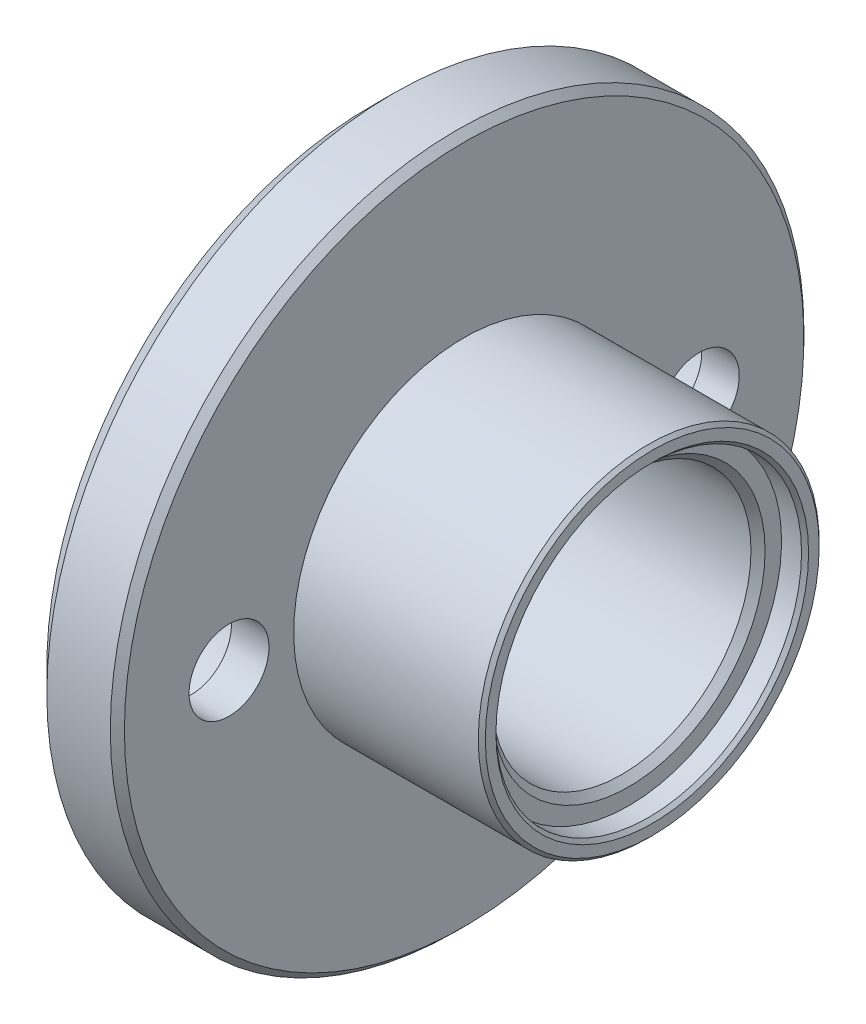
ISO-10303-21;
HEADER;
FILE_DESCRIPTION(('STEP AP214'),'2;1');
FILE_NAME('part.step','',(''),(''),'','','');
FILE_SCHEMA(('AUTOMOTIVE_DESIGN { 1 0 10303 214 1 1 1 1 }'));
ENDSEC;
DATA;
#1=APPLICATION_CONTEXT('core data for automotive mechanical design processes');
#2=APPLICATION_PROTOCOL_DEFINITION('international standard','automotive_design',2000,#1);
#3=PRODUCT_CONTEXT('',#1,'mechanical');
#4=PRODUCT('Part','Part','',(#3));
#5=PRODUCT_RELATED_PRODUCT_CATEGORY('part','',(#4));
#6=PRODUCT_DEFINITION_FORMATION('','',#4);
#7=PRODUCT_DEFINITION_CONTEXT('part definition',#1,'design');
#8=PRODUCT_DEFINITION('design','',#6,#7);
#9=PRODUCT_DEFINITION_SHAPE('','',#8);
#10=(LENGTH_UNIT() NAMED_UNIT(*) SI_UNIT(.MILLI.,.METRE.));
#11=(NAMED_UNIT(*) PLANE_ANGLE_UNIT() SI_UNIT($,.RADIAN.));
#12=(NAMED_UNIT(*) SI_UNIT($,.STERADIAN.) SOLID_ANGLE_UNIT());
#13=UNCERTAINTY_MEASURE_WITH_UNIT(LENGTH_MEASURE(1.E-05),#10,'distance_accuracy_value','');
#14=(GEOMETRIC_REPRESENTATION_CONTEXT(3) GLOBAL_UNCERTAINTY_ASSIGNED_CONTEXT((#13)) GLOBAL_UNIT_ASSIGNED_CONTEXT((#10,
#11,#12)) REPRESENTATION_CONTEXT('',''));
#15=CARTESIAN_POINT('',(0.,0.,0.));
#16=DIRECTION('',(0.,0.,1.));
#17=DIRECTION('',(1.,0.,0.));
#18=AXIS2_PLACEMENT_3D('',#15,#16,#17);
#19=CARTESIAN_POINT('',(12.6,0.,0.));
#20=DIRECTION('',(-1.,0.,0.));
#21=DIRECTION('',(0.,-1.,0.));
#22=AXIS2_PLACEMENT_3D('',#19,#20,#21);
#23=CYLINDRICAL_SURFACE('',#22,6.5);
#24=CARTESIAN_POINT('',(11.8499999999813,0.,0.));
#25=DIRECTION('',(1.,0.,0.));
#26=DIRECTION('',(0.,0.,-1.));
#27=AXIS2_PLACEMENT_3D('',#24,#25,#26);
#28=CIRCLE('',#27,6.50000000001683);
#29=CARTESIAN_POINT('',(11.8499999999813,0.,-6.50000000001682));
#30=VERTEX_POINT('',#29);
#31=EDGE_CURVE('E29',#30,#30,#28,.T.);
#32=ORIENTED_EDGE('',*,*,#31,.T.);
#33=EDGE_LOOP('',(#32));
#34=FACE_BOUND('',#33,.T.);
#35=CARTESIAN_POINT('',(11.,0.,0.));
#36=DIRECTION('',(-1.,0.,0.));
#37=DIRECTION('',(0.,-1.,0.));
#38=AXIS2_PLACEMENT_3D('',#35,#36,#37);
#39=CIRCLE('',#38,6.5);
#40=CARTESIAN_POINT('',(11.,-6.5,0.));
#41=VERTEX_POINT('',#40);
#42=EDGE_CURVE('E17',#41,#41,#39,.T.);
#43=ORIENTED_EDGE('',*,*,#42,.T.);
#44=EDGE_LOOP('',(#43));
#45=FACE_BOUND('',#44,.T.);
#46=ADVANCED_FACE('F14',(#34,#45),#23,.F.);
#47=CARTESIAN_POINT('',(11.9999999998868,0.,0.));
#48=DIRECTION('',(1.,0.,0.));
#49=DIRECTION('',(0.,0.,-1.));
#50=AXIS2_PLACEMENT_3D('',#47,#48,#49);
#51=CONICAL_SURFACE('',#50,6.64999999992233,0.785398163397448);
#52=ORIENTED_EDGE('',*,*,#31,.F.);
#53=EDGE_LOOP('',(#52));
#54=FACE_BOUND('',#53,.T.);
#55=CARTESIAN_POINT('',(12.0000000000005,0.,0.));
#56=DIRECTION('',(1.,0.,0.));
#57=DIRECTION('',(0.,0.,-1.));
#58=AXIS2_PLACEMENT_3D('',#55,#56,#57);
#59=CIRCLE('',#58,6.65000000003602);
#60=CARTESIAN_POINT('',(12.0000000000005,0.,-6.65000000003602));
#61=VERTEX_POINT('',#60);
#62=EDGE_CURVE('E77',#61,#61,#59,.T.);
#63=ORIENTED_EDGE('',*,*,#62,.T.);
#64=EDGE_LOOP('',(#63));
#65=FACE_BOUND('',#64,.T.);
#66=ADVANCED_FACE('F88',(#54,#65),#51,.F.);
#67=CARTESIAN_POINT('',(11.,0.,0.));
#68=DIRECTION('',(-1.,0.,0.));
#69=DIRECTION('',(0.,-1.,0.));
#70=AXIS2_PLACEMENT_3D('',#67,#68,#69);
#71=PLANE('',#70);
#72=ORIENTED_EDGE('',*,*,#42,.F.);
#73=EDGE_LOOP('',(#72));
#74=FACE_BOUND('',#73,.T.);
#75=CARTESIAN_POINT('',(11.0000000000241,0.,0.));
#76=DIRECTION('',(1.,0.,0.));
#77=DIRECTION('',(0.,0.,-1.));
#78=AXIS2_PLACEMENT_3D('',#75,#76,#77);
#79=CIRCLE('',#78,5.80000000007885);
#80=CARTESIAN_POINT('',(11.0000000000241,0.,-5.80000000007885));
#81=VERTEX_POINT('',#80);
#82=EDGE_CURVE('E75',#81,#81,#79,.F.);
#83=ORIENTED_EDGE('',*,*,#82,.T.);
#84=EDGE_LOOP('',(#83));
#85=FACE_BOUND('',#84,.T.);
#86=ADVANCED_FACE('F90',(#74,#85),#71,.F.);
#87=CARTESIAN_POINT('',(12.0000000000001,0.,0.));
#88=DIRECTION('',(-1.,0.,0.));
#89=DIRECTION('',(0.,-1.,0.));
#90=AXIS2_PLACEMENT_3D('',#87,#88,#89);
#91=PLANE('',#90);
#92=CARTESIAN_POINT('',(12.,0.,1.11022302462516E-13));
#93=DIRECTION('',(-1.,0.,0.));
#94=DIRECTION('',(0.,0.,1.));
#95=AXIS2_PLACEMENT_3D('',#92,#93,#94);
#96=CIRCLE('',#95,7.10000000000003);
#97=CARTESIAN_POINT('',(12.,0.,7.10000000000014));
#98=VERTEX_POINT('',#97);
#99=EDGE_CURVE('E71',#98,#98,#96,.T.);
#100=ORIENTED_EDGE('',*,*,#99,.F.);
#101=EDGE_LOOP('',(#100));
#102=FACE_BOUND('',#101,.T.);
#103=ORIENTED_EDGE('',*,*,#62,.F.);
#104=EDGE_LOOP('',(#103));
#105=FACE_BOUND('',#104,.T.);
#106=ADVANCED_FACE('F96',(#102,#105),#91,.F.);
#107=CARTESIAN_POINT('',(11.0000000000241,0.,0.));
#108=DIRECTION('',(1.,0.,0.));
#109=DIRECTION('',(0.,0.,-1.));
#110=AXIS2_PLACEMENT_3D('',#107,#108,#109);
#111=CONICAL_SURFACE('',#110,5.80000000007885,0.785398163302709);
#112=CARTESIAN_POINT('',(10.7,0.,0.));
#113=DIRECTION('',(-1.,0.,0.));
#114=DIRECTION('',(0.,-1.,0.));
#115=AXIS2_PLACEMENT_3D('',#112,#113,#114);
#116=CIRCLE('',#115,5.5);
#117=CARTESIAN_POINT('',(10.7,-5.5,0.));
#118=VERTEX_POINT('',#117);
#119=EDGE_CURVE('E74',#118,#118,#116,.T.);
#120=ORIENTED_EDGE('',*,*,#119,.T.);
#121=EDGE_LOOP('',(#120));
#122=FACE_BOUND('',#121,.T.);
#123=ORIENTED_EDGE('',*,*,#82,.F.);
#124=EDGE_LOOP('',(#123));
#125=FACE_BOUND('',#124,.T.);
#126=ADVANCED_FACE('F181',(#122,#125),#111,.F.);
#127=CARTESIAN_POINT('',(11.85,0.,1.11022302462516E-13));
#128=DIRECTION('',(-1.,0.,0.));
#129=DIRECTION('',(0.,0.,1.));
#130=AXIS2_PLACEMENT_3D('',#127,#128,#129);
#131=CONICAL_SURFACE('',#130,7.24999999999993,0.785398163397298);
#132=ORIENTED_EDGE('',*,*,#99,.T.);
#133=EDGE_LOOP('',(#132));
#134=FACE_BOUND('',#133,.T.);
#135=CARTESIAN_POINT('',(11.85,0.,0.));
#136=DIRECTION('',(-1.,0.,0.));
#137=DIRECTION('',(0.,-1.,0.));
#138=AXIS2_PLACEMENT_3D('',#135,#136,#137);
#139=CIRCLE('',#138,7.25);
#140=CARTESIAN_POINT('',(11.85,-7.25,0.));
#141=VERTEX_POINT('',#140);
#142=EDGE_CURVE('E70',#141,#141,#139,.T.);
#143=ORIENTED_EDGE('',*,*,#142,.F.);
#144=EDGE_LOOP('',(#143));
#145=FACE_BOUND('',#144,.T.);
#146=ADVANCED_FACE('F177',(#134,#145),#131,.T.);
#147=CARTESIAN_POINT('',(12.6,0.,0.));
#148=DIRECTION('',(-1.,0.,0.));
#149=DIRECTION('',(0.,-1.,0.));
#150=AXIS2_PLACEMENT_3D('',#147,#148,#149);
#151=CYLINDRICAL_SURFACE('',#150,5.5);
#152=ORIENTED_EDGE('',*,*,#119,.F.);
#153=EDGE_LOOP('',(#152));
#154=FACE_BOUND('',#153,.T.);
#155=CARTESIAN_POINT('',(2.,0.,0.));
#156=DIRECTION('',(-1.,0.,0.));
#157=DIRECTION('',(0.,-1.,0.));
#158=AXIS2_PLACEMENT_3D('',#155,#156,#157);
#159=CIRCLE('',#158,5.5);
#160=CARTESIAN_POINT('',(2.,-5.5,0.));
#161=VERTEX_POINT('',#160);
#162=EDGE_CURVE('E67',#161,#161,#159,.T.);
#163=ORIENTED_EDGE('',*,*,#162,.T.);
#164=EDGE_LOOP('',(#163));
#165=FACE_BOUND('',#164,.T.);
#166=ADVANCED_FACE('F173',(#154,#165),#151,.F.);
#167=CARTESIAN_POINT('',(12.6,0.,0.));
#168=DIRECTION('',(-1.,0.,0.));
#169=DIRECTION('',(0.,-1.,0.));
#170=AXIS2_PLACEMENT_3D('',#167,#168,#169);
#171=CYLINDRICAL_SURFACE('',#170,7.25);
#172=ORIENTED_EDGE('',*,*,#142,.T.);
#173=EDGE_LOOP('',(#172));
#174=FACE_BOUND('',#173,.T.);
#175=CARTESIAN_POINT('',(4.00000000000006,0.,0.));
#176=DIRECTION('',(-1.,0.,0.));
#177=DIRECTION('',(0.,-1.,0.));
#178=AXIS2_PLACEMENT_3D('',#175,#176,#177);
#179=CIRCLE('',#178,7.25);
#180=CARTESIAN_POINT('',(4.00000000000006,-7.25,0.));
#181=VERTEX_POINT('',#180);
#182=EDGE_CURVE('E61',#181,#181,#179,.F.);
#183=ORIENTED_EDGE('',*,*,#182,.T.);
#184=EDGE_LOOP('',(#183));
#185=FACE_BOUND('',#184,.T.);
#186=ADVANCED_FACE('F169',(#174,#185),#171,.T.);
#187=CARTESIAN_POINT('',(10.5,0.,10.));
#188=DIRECTION('',(-1.,0.,0.));
#189=DIRECTION('',(0.,-1.,0.));
#190=AXIS2_PLACEMENT_3D('',#187,#188,#189);
#191=CYLINDRICAL_SURFACE('',#190,1.7);
#192=CARTESIAN_POINT('',(4.00000000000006,0.,10.));
#193=DIRECTION('',(-1.,0.,0.));
#194=DIRECTION('',(0.,-1.,0.));
#195=AXIS2_PLACEMENT_3D('',#192,#193,#194);
#196=CIRCLE('',#195,1.7);
#197=CARTESIAN_POINT('',(4.00000000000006,-1.7,10.));
#198=VERTEX_POINT('',#197);
#199=EDGE_CURVE('E64',#198,#198,#196,.F.);
#200=ORIENTED_EDGE('',*,*,#199,.T.);
#201=EDGE_LOOP('',(#200));
#202=FACE_BOUND('',#201,.T.);
#203=CARTESIAN_POINT('',(2.40000000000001,0.,10.));
#204=DIRECTION('',(-1.,0.,0.));
#205=DIRECTION('',(0.,-1.,0.));
#206=AXIS2_PLACEMENT_3D('',#203,#204,#205);
#207=CIRCLE('',#206,1.7);
#208=CARTESIAN_POINT('',(2.40000000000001,-1.7,10.));
#209=VERTEX_POINT('',#208);
#210=EDGE_CURVE('E55',#209,#209,#207,.F.);
#211=ORIENTED_EDGE('',*,*,#210,.F.);
#212=EDGE_LOOP('',(#211));
#213=FACE_BOUND('',#212,.T.);
#214=ADVANCED_FACE('F165',(#202,#213),#191,.F.);
#215=CARTESIAN_POINT('',(2.,0.,0.));
#216=DIRECTION('',(-1.,0.,0.));
#217=DIRECTION('',(0.,-1.,0.));
#218=AXIS2_PLACEMENT_3D('',#215,#216,#217);
#219=PLANE('',#218);
#220=ORIENTED_EDGE('',*,*,#162,.F.);
#221=EDGE_LOOP('',(#220));
#222=FACE_BOUND('',#221,.T.);
#223=CARTESIAN_POINT('',(2.00000000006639,0.,0.));
#224=DIRECTION('',(1.,0.,0.));
#225=DIRECTION('',(0.,0.,-1.));
#226=AXIS2_PLACEMENT_3D('',#223,#224,#225);
#227=CIRCLE('',#226,2.64999999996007);
#228=CARTESIAN_POINT('',(2.00000000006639,0.,-2.64999999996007));
#229=VERTEX_POINT('',#228);
#230=EDGE_CURVE('E52',#229,#229,#227,.F.);
#231=ORIENTED_EDGE('',*,*,#230,.T.);
#232=EDGE_LOOP('',(#231));
#233=FACE_BOUND('',#232,.T.);
#234=ADVANCED_FACE('F161',(#222,#233),#219,.F.);
#235=CARTESIAN_POINT('',(10.5,0.,-10.));
#236=DIRECTION('',(-1.,0.,0.));
#237=DIRECTION('',(0.,-1.,0.));
#238=AXIS2_PLACEMENT_3D('',#235,#236,#237);
#239=CYLINDRICAL_SURFACE('',#238,1.7);
#240=CARTESIAN_POINT('',(4.00000000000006,0.,-10.));
#241=DIRECTION('',(-1.,0.,0.));
#242=DIRECTION('',(0.,-1.,0.));
#243=AXIS2_PLACEMENT_3D('',#240,#241,#242);
#244=CIRCLE('',#243,1.7);
#245=CARTESIAN_POINT('',(4.00000000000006,-1.7,-10.));
#246=VERTEX_POINT('',#245);
#247=EDGE_CURVE('E58',#246,#246,#244,.F.);
#248=ORIENTED_EDGE('',*,*,#247,.T.);
#249=EDGE_LOOP('',(#248));
#250=FACE_BOUND('',#249,.T.);
#251=CARTESIAN_POINT('',(2.40000000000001,0.,-10.));
#252=DIRECTION('',(-1.,0.,0.));
#253=DIRECTION('',(0.,-1.,0.));
#254=AXIS2_PLACEMENT_3D('',#251,#252,#253);
#255=CIRCLE('',#254,1.7);
#256=CARTESIAN_POINT('',(2.40000000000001,-1.7,-10.));
#257=VERTEX_POINT('',#256);
#258=EDGE_CURVE('E49',#257,#257,#255,.F.);
#259=ORIENTED_EDGE('',*,*,#258,.F.);
#260=EDGE_LOOP('',(#259));
#261=FACE_BOUND('',#260,.T.);
#262=ADVANCED_FACE('F157',(#250,#261),#239,.F.);
#263=CARTESIAN_POINT('',(4.00000000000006,0.,1.11022302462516E-13));
#264=DIRECTION('',(-1.,0.,0.));
#265=DIRECTION('',(0.,-1.,0.));
#266=AXIS2_PLACEMENT_3D('',#263,#264,#265);
#267=PLANE('',#266);
#268=CARTESIAN_POINT('',(4.00000000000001,0.,0.));
#269=DIRECTION('',(-1.,0.,0.));
#270=DIRECTION('',(0.,0.,1.));
#271=AXIS2_PLACEMENT_3D('',#268,#269,#270);
#272=CIRCLE('',#271,14.4500000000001);
#273=CARTESIAN_POINT('',(4.00000000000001,0.,14.4500000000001));
#274=VERTEX_POINT('',#273);
#275=EDGE_CURVE('E46',#274,#274,#272,.T.);
#276=ORIENTED_EDGE('',*,*,#275,.F.);
#277=EDGE_LOOP('',(#276));
#278=FACE_BOUND('',#277,.T.);
#279=ORIENTED_EDGE('',*,*,#247,.F.);
#280=EDGE_LOOP('',(#279));
#281=FACE_BOUND('',#280,.T.);
#282=ORIENTED_EDGE('',*,*,#182,.F.);
#283=EDGE_LOOP('',(#282));
#284=FACE_BOUND('',#283,.T.);
#285=ORIENTED_EDGE('',*,*,#199,.F.);
#286=EDGE_LOOP('',(#285));
#287=FACE_BOUND('',#286,.T.);
#288=ADVANCED_FACE('F153',(#278,#281,#284,#287),#267,.F.);
#289=CARTESIAN_POINT('',(2.40000000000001,0.,10.));
#290=DIRECTION('',(-1.,0.,0.));
#291=DIRECTION('',(0.,-1.,0.));
#292=AXIS2_PLACEMENT_3D('',#289,#290,#291);
#293=PLANE('',#292);
#294=CARTESIAN_POINT('',(2.40000000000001,0.,10.));
#295=DIRECTION('',(-1.,0.,0.));
#296=DIRECTION('',(0.,-1.,0.));
#297=AXIS2_PLACEMENT_3D('',#294,#295,#296);
#298=CIRCLE('',#297,3.);
#299=CARTESIAN_POINT('',(2.40000000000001,-3.,10.));
#300=VERTEX_POINT('',#299);
#301=EDGE_CURVE('E43',#300,#300,#298,.T.);
#302=ORIENTED_EDGE('',*,*,#301,.T.);
#303=EDGE_LOOP('',(#302));
#304=FACE_BOUND('',#303,.T.);
#305=ORIENTED_EDGE('',*,*,#210,.T.);
#306=EDGE_LOOP('',(#305));
#307=FACE_BOUND('',#306,.T.);
#308=ADVANCED_FACE('F149',(#304,#307),#293,.T.);
#309=CARTESIAN_POINT('',(2.00000000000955,0.,0.));
#310=DIRECTION('',(1.,0.,0.));
#311=DIRECTION('',(0.,0.,-1.));
#312=AXIS2_PLACEMENT_3D('',#309,#310,#311);
#313=CONICAL_SURFACE('',#312,2.64999999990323,0.785398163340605);
#314=CARTESIAN_POINT('',(1.5,0.,0.));
#315=DIRECTION('',(-1.,0.,0.));
#316=DIRECTION('',(0.,-1.,0.));
#317=AXIS2_PLACEMENT_3D('',#314,#315,#316);
#318=CIRCLE('',#317,2.15);
#319=CARTESIAN_POINT('',(1.5,-2.15,0.));
#320=VERTEX_POINT('',#319);
#321=EDGE_CURVE('E42',#320,#320,#318,.T.);
#322=ORIENTED_EDGE('',*,*,#321,.T.);
#323=EDGE_LOOP('',(#322));
#324=FACE_BOUND('',#323,.T.);
#325=ORIENTED_EDGE('',*,*,#230,.F.);
#326=EDGE_LOOP('',(#325));
#327=FACE_BOUND('',#326,.T.);
#328=ADVANCED_FACE('F145',(#324,#327),#313,.F.);
#329=CARTESIAN_POINT('',(2.40000000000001,0.,-10.));
#330=DIRECTION('',(-1.,0.,0.));
#331=DIRECTION('',(0.,-1.,0.));
#332=AXIS2_PLACEMENT_3D('',#329,#330,#331);
#333=PLANE('',#332);
#334=CARTESIAN_POINT('',(2.40000000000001,0.,-10.));
#335=DIRECTION('',(-1.,0.,0.));
#336=DIRECTION('',(0.,-1.,0.));
#337=AXIS2_PLACEMENT_3D('',#334,#335,#336);
#338=CIRCLE('',#337,3.);
#339=CARTESIAN_POINT('',(2.40000000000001,-3.,-10.));
#340=VERTEX_POINT('',#339);
#341=EDGE_CURVE('E38',#340,#340,#338,.T.);
#342=ORIENTED_EDGE('',*,*,#341,.T.);
#343=EDGE_LOOP('',(#342));
#344=FACE_BOUND('',#343,.T.);
#345=ORIENTED_EDGE('',*,*,#258,.T.);
#346=EDGE_LOOP('',(#345));
#347=FACE_BOUND('',#346,.T.);
#348=ADVANCED_FACE('F141',(#344,#347),#333,.T.);
#349=CARTESIAN_POINT('',(3.70000000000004,0.,0.));
#350=DIRECTION('',(-1.,0.,0.));
#351=DIRECTION('',(0.,0.,1.));
#352=AXIS2_PLACEMENT_3D('',#349,#350,#351);
#353=CONICAL_SURFACE('',#352,14.75,0.785398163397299);
#354=CARTESIAN_POINT('',(3.70000000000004,0.,0.));
#355=DIRECTION('',(-1.,0.,0.));
#356=DIRECTION('',(0.,-1.,0.));
#357=AXIS2_PLACEMENT_3D('',#354,#355,#356);
#358=CIRCLE('',#357,14.75);
#359=CARTESIAN_POINT('',(3.70000000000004,-14.75,0.));
#360=VERTEX_POINT('',#359);
#361=EDGE_CURVE('E41',#360,#360,#358,.T.);
#362=ORIENTED_EDGE('',*,*,#361,.F.);
#363=EDGE_LOOP('',(#362));
#364=FACE_BOUND('',#363,.T.);
#365=ORIENTED_EDGE('',*,*,#275,.T.);
#366=EDGE_LOOP('',(#365));
#367=FACE_BOUND('',#366,.T.);
#368=ADVANCED_FACE('F137',(#364,#367),#353,.T.);
#369=CARTESIAN_POINT('',(10.5,0.,10.));
#370=DIRECTION('',(-1.,0.,0.));
#371=DIRECTION('',(0.,-1.,0.));
#372=AXIS2_PLACEMENT_3D('',#369,#370,#371);
#373=CYLINDRICAL_SURFACE('',#372,3.);
#374=ORIENTED_EDGE('',*,*,#301,.F.);
#375=EDGE_LOOP('',(#374));
#376=FACE_BOUND('',#375,.T.);
#377=CARTESIAN_POINT('',(0.199999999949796,0.,10.));
#378=DIRECTION('',(-1.,0.,0.));
#379=DIRECTION('',(0.,0.,1.));
#380=AXIS2_PLACEMENT_3D('',#377,#378,#379);
#381=CIRCLE('',#380,2.9999999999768);
#382=CARTESIAN_POINT('',(0.199999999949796,0.,12.9999999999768));
#383=VERTEX_POINT('',#382);
#384=EDGE_CURVE('E202',#383,#383,#381,.T.);
#385=ORIENTED_EDGE('',*,*,#384,.T.);
#386=EDGE_LOOP('',(#385));
#387=FACE_BOUND('',#386,.T.);
#388=ADVANCED_FACE('F133',(#376,#387),#373,.F.);
#389=CARTESIAN_POINT('',(12.6,0.,0.));
#390=DIRECTION('',(-1.,0.,0.));
#391=DIRECTION('',(0.,-1.,0.));
#392=AXIS2_PLACEMENT_3D('',#389,#390,#391);
#393=CYLINDRICAL_SURFACE('',#392,2.15);
#394=ORIENTED_EDGE('',*,*,#321,.F.);
#395=EDGE_LOOP('',(#394));
#396=FACE_BOUND('',#395,.T.);
#397=CARTESIAN_POINT('',(0.499999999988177,0.,0.));
#398=DIRECTION('',(-1.,0.,0.));
#399=DIRECTION('',(0.,0.,1.));
#400=AXIS2_PLACEMENT_3D('',#397,#398,#399);
#401=CIRCLE('',#400,2.15000000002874);
#402=CARTESIAN_POINT('',(0.499999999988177,0.,2.15000000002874));
#403=VERTEX_POINT('',#402);
#404=EDGE_CURVE('E205',#403,#403,#401,.T.);
#405=ORIENTED_EDGE('',*,*,#404,.T.);
#406=EDGE_LOOP('',(#405));
#407=FACE_BOUND('',#406,.T.);
#408=ADVANCED_FACE('F129',(#396,#407),#393,.F.);
#409=CARTESIAN_POINT('',(10.5,0.,-10.));
#410=DIRECTION('',(-1.,0.,0.));
#411=DIRECTION('',(0.,-1.,0.));
#412=AXIS2_PLACEMENT_3D('',#409,#410,#411);
#413=CYLINDRICAL_SURFACE('',#412,3.);
#414=ORIENTED_EDGE('',*,*,#341,.F.);
#415=EDGE_LOOP('',(#414));
#416=FACE_BOUND('',#415,.T.);
#417=CARTESIAN_POINT('',(0.200000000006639,0.,-10.));
#418=DIRECTION('',(-1.,0.,0.));
#419=DIRECTION('',(0.,0.,1.));
#420=AXIS2_PLACEMENT_3D('',#417,#418,#419);
#421=CIRCLE('',#420,2.99999999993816);
#422=CARTESIAN_POINT('',(0.200000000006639,0.,-7.00000000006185));
#423=VERTEX_POINT('',#422);
#424=EDGE_CURVE('E208',#423,#423,#421,.T.);
#425=ORIENTED_EDGE('',*,*,#424,.T.);
#426=EDGE_LOOP('',(#425));
#427=FACE_BOUND('',#426,.T.);
#428=ADVANCED_FACE('F125',(#416,#427),#413,.F.);
#429=CARTESIAN_POINT('',(12.6,0.,0.));
#430=DIRECTION('',(-1.,0.,0.));
#431=DIRECTION('',(0.,-1.,0.));
#432=AXIS2_PLACEMENT_3D('',#429,#430,#431);
#433=CYLINDRICAL_SURFACE('',#432,14.75);
#434=CARTESIAN_POINT('',(1.00000000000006,0.,0.));
#435=DIRECTION('',(1.,0.,0.));
#436=DIRECTION('',(0.,0.,-1.));
#437=AXIS2_PLACEMENT_3D('',#434,#435,#436);
#438=CIRCLE('',#437,14.7499999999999);
#439=CARTESIAN_POINT('',(1.00000000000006,0.,-14.7499999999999));
#440=VERTEX_POINT('',#439);
#441=EDGE_CURVE('E37',#440,#440,#438,.F.);
#442=ORIENTED_EDGE('',*,*,#441,.F.);
#443=EDGE_LOOP('',(#442));
#444=FACE_BOUND('',#443,.T.);
#445=ORIENTED_EDGE('',*,*,#361,.T.);
#446=EDGE_LOOP('',(#445));
#447=FACE_BOUND('',#446,.T.);
#448=ADVANCED_FACE('F121',(#444,#447),#433,.T.);
#449=CARTESIAN_POINT('',(-1.70530256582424E-10,0.,10.));
#450=DIRECTION('',(-1.,0.,0.));
#451=DIRECTION('',(0.,0.,1.));
#452=AXIS2_PLACEMENT_3D('',#449,#450,#451);
#453=CONICAL_SURFACE('',#452,3.20000000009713,0.785398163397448);
#454=ORIENTED_EDGE('',*,*,#384,.F.);
#455=EDGE_LOOP('',(#454));
#456=FACE_BOUND('',#455,.T.);
#457=CARTESIAN_POINT('',(-1.13686837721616E-10,0.,10.));
#458=DIRECTION('',(-1.,0.,0.));
#459=DIRECTION('',(0.,0.,1.));
#460=AXIS2_PLACEMENT_3D('',#457,#458,#459);
#461=CIRCLE('',#460,3.20000000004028);
#462=CARTESIAN_POINT('',(-1.13686837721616E-10,0.,13.2000000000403));
#463=VERTEX_POINT('',#462);
#464=EDGE_CURVE('E34',#463,#463,#461,.F.);
#465=ORIENTED_EDGE('',*,*,#464,.F.);
#466=EDGE_LOOP('',(#465));
#467=FACE_BOUND('',#466,.T.);
#468=ADVANCED_FACE('F117',(#456,#467),#453,.F.);
#469=CARTESIAN_POINT('',(0.,0.,0.));
#470=DIRECTION('',(-1.,0.,0.));
#471=DIRECTION('',(0.,-1.,0.));
#472=AXIS2_PLACEMENT_3D('',#469,#470,#471);
#473=CONICAL_SURFACE('',#472,2.65000000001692,0.785398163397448);
#474=ORIENTED_EDGE('',*,*,#404,.F.);
#475=EDGE_LOOP('',(#474));
#476=FACE_BOUND('',#475,.T.);
#477=CARTESIAN_POINT('',(0.,0.,0.));
#478=DIRECTION('',(-1.,0.,0.));
#479=DIRECTION('',(0.,-1.,0.));
#480=AXIS2_PLACEMENT_3D('',#477,#478,#479);
#481=CIRCLE('',#480,2.65000000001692);
#482=CARTESIAN_POINT('',(0.,-2.65000000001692,0.));
#483=VERTEX_POINT('',#482);
#484=EDGE_CURVE('E26',#483,#483,#481,.F.);
#485=ORIENTED_EDGE('',*,*,#484,.F.);
#486=EDGE_LOOP('',(#485));
#487=FACE_BOUND('',#486,.T.);
#488=ADVANCED_FACE('F113',(#476,#487),#473,.F.);
#489=CARTESIAN_POINT('',(-1.13686837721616E-10,0.,-10.));
#490=DIRECTION('',(-1.,0.,0.));
#491=DIRECTION('',(0.,0.,1.));
#492=AXIS2_PLACEMENT_3D('',#489,#490,#491);
#493=CONICAL_SURFACE('',#492,3.20000000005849,0.785398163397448);
#494=ORIENTED_EDGE('',*,*,#424,.F.);
#495=EDGE_LOOP('',(#494));
#496=FACE_BOUND('',#495,.T.);
#497=CARTESIAN_POINT('',(-5.6843418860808E-11,0.,-10.));
#498=DIRECTION('',(-1.,0.,0.));
#499=DIRECTION('',(0.,0.,1.));
#500=AXIS2_PLACEMENT_3D('',#497,#498,#499);
#501=CIRCLE('',#500,3.20000000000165);
#502=CARTESIAN_POINT('',(-5.6843418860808E-11,0.,-6.79999999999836));
#503=VERTEX_POINT('',#502);
#504=EDGE_CURVE('E21',#503,#503,#501,.F.);
#505=ORIENTED_EDGE('',*,*,#504,.F.);
#506=EDGE_LOOP('',(#505));
#507=FACE_BOUND('',#506,.T.);
#508=ADVANCED_FACE('F106',(#496,#507),#493,.F.);
#509=CARTESIAN_POINT('',(1.00000000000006,0.,0.));
#510=DIRECTION('',(1.,0.,0.));
#511=DIRECTION('',(0.,0.,-1.));
#512=AXIS2_PLACEMENT_3D('',#509,#510,#511);
#513=CONICAL_SURFACE('',#512,14.7499999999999,0.7853981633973);
#514=ORIENTED_EDGE('',*,*,#441,.T.);
#515=EDGE_LOOP('',(#514));
#516=FACE_BOUND('',#515,.T.);
#517=CARTESIAN_POINT('',(0.,0.,0.));
#518=DIRECTION('',(1.,0.,0.));
#519=DIRECTION('',(0.,0.,-1.));
#520=AXIS2_PLACEMENT_3D('',#517,#518,#519);
#521=CIRCLE('',#520,13.7500000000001);
#522=CARTESIAN_POINT('',(0.,0.,-13.7500000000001));
#523=VERTEX_POINT('',#522);
#524=EDGE_CURVE('E10',#523,#523,#521,.F.);
#525=ORIENTED_EDGE('',*,*,#524,.F.);
#526=EDGE_LOOP('',(#525));
#527=FACE_BOUND('',#526,.T.);
#528=ADVANCED_FACE('F101',(#516,#527),#513,.T.);
#529=CARTESIAN_POINT('',(0.,0.,0.));
#530=DIRECTION('',(-1.,0.,0.));
#531=DIRECTION('',(0.,-1.,0.));
#532=AXIS2_PLACEMENT_3D('',#529,#530,#531);
#533=PLANE('',#532);
#534=ORIENTED_EDGE('',*,*,#524,.T.);
#535=EDGE_LOOP('',(#534));
#536=FACE_BOUND('',#535,.T.);
#537=ORIENTED_EDGE('',*,*,#504,.T.);
#538=EDGE_LOOP('',(#537));
#539=FACE_BOUND('',#538,.T.);
#540=ORIENTED_EDGE('',*,*,#484,.T.);
#541=EDGE_LOOP('',(#540));
#542=FACE_BOUND('',#541,.T.);
#543=ORIENTED_EDGE('',*,*,#464,.T.);
#544=EDGE_LOOP('',(#543));
#545=FACE_BOUND('',#544,.T.);
#546=ADVANCED_FACE('F99',(#536,#539,#542,#545),#533,.T.);
#547=CLOSED_SHELL('',(#46,#66,#86,#106,#126,#146,#166,#186,#214,#234,#262,#288,#308,#328,#348,
#368,#388,#408,#428,#448,#468,#488,#508,#528,#546));
#548=MANIFOLD_SOLID_BREP('B1',#547);
#549=ADVANCED_BREP_SHAPE_REPRESENTATION('',(#18,#548),#14);
#550=SHAPE_DEFINITION_REPRESENTATION(#9,#549);
ENDSEC;
END-ISO-10303-21;
